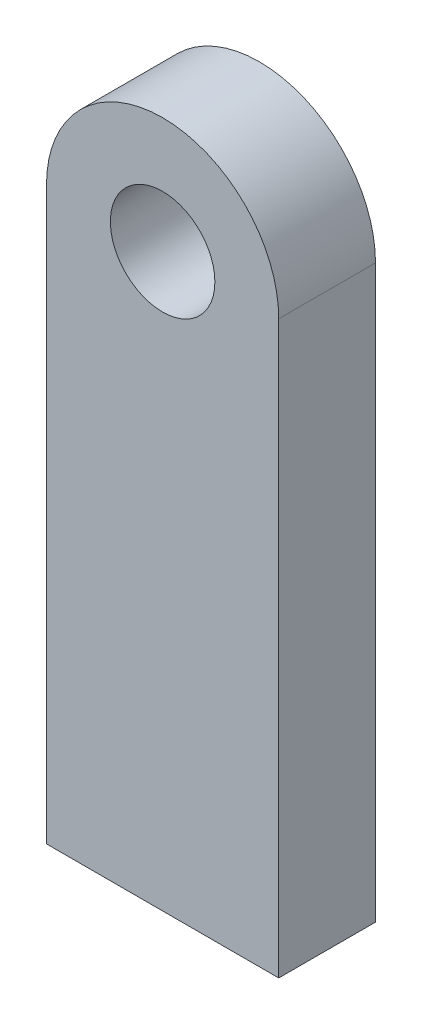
ISO-10303-21;
HEADER;
FILE_DESCRIPTION(('STEP AP214'),'2;1');
FILE_NAME('part.step','',(''),(''),'','','');
FILE_SCHEMA(('AUTOMOTIVE_DESIGN { 1 0 10303 214 1 1 1 1 }'));
ENDSEC;
DATA;
#1=APPLICATION_CONTEXT('core data for automotive mechanical design processes');
#2=APPLICATION_PROTOCOL_DEFINITION('international standard','automotive_design',2000,#1);
#3=PRODUCT_CONTEXT('',#1,'mechanical');
#4=PRODUCT('Part','Part','',(#3));
#5=PRODUCT_RELATED_PRODUCT_CATEGORY('part','',(#4));
#6=PRODUCT_DEFINITION_FORMATION('','',#4);
#7=PRODUCT_DEFINITION_CONTEXT('part definition',#1,'design');
#8=PRODUCT_DEFINITION('design','',#6,#7);
#9=PRODUCT_DEFINITION_SHAPE('','',#8);
#10=(LENGTH_UNIT() NAMED_UNIT(*) SI_UNIT(.MILLI.,.METRE.));
#11=(NAMED_UNIT(*) PLANE_ANGLE_UNIT() SI_UNIT($,.RADIAN.));
#12=(NAMED_UNIT(*) SI_UNIT($,.STERADIAN.) SOLID_ANGLE_UNIT());
#13=UNCERTAINTY_MEASURE_WITH_UNIT(LENGTH_MEASURE(1.E-05),#10,'distance_accuracy_value','');
#14=(GEOMETRIC_REPRESENTATION_CONTEXT(3) GLOBAL_UNCERTAINTY_ASSIGNED_CONTEXT((#13)) GLOBAL_UNIT_ASSIGNED_CONTEXT((#10,
#11,#12)) REPRESENTATION_CONTEXT('',''));
#15=CARTESIAN_POINT('',(0.,0.,0.));
#16=DIRECTION('',(0.,0.,1.));
#17=DIRECTION('',(1.,0.,0.));
#18=AXIS2_PLACEMENT_3D('',#15,#16,#17);
#19=CARTESIAN_POINT('',(7.62,37.465,6.35));
#20=DIRECTION('',(0.,0.,-1.));
#21=DIRECTION('',(-1.,0.,0.));
#22=AXIS2_PLACEMENT_3D('',#19,#20,#21);
#23=CYLINDRICAL_SURFACE('',#22,7.62);
#24=CARTESIAN_POINT('',(7.62,37.465,0.));
#25=DIRECTION('',(0.,0.,1.));
#26=DIRECTION('',(1.,0.,0.));
#27=AXIS2_PLACEMENT_3D('',#24,#25,#26);
#28=CIRCLE('',#27,7.62);
#29=CARTESIAN_POINT('',(0.,37.465,0.));
#30=VERTEX_POINT('',#29);
#31=CARTESIAN_POINT('',(15.24,37.465,0.));
#32=VERTEX_POINT('',#31);
#33=EDGE_CURVE('E125',#30,#32,#28,.F.);
#34=ORIENTED_EDGE('',*,*,#33,.F.);
#35=DIRECTION('',(0.,0.,-1.));
#36=VECTOR('',#35,1.);
#37=CARTESIAN_POINT('',(0.,37.465,6.35));
#38=LINE('',#37,#36);
#39=CARTESIAN_POINT('',(0.,37.465,6.35));
#40=VERTEX_POINT('',#39);
#41=EDGE_CURVE('E11',#40,#30,#38,.T.);
#42=ORIENTED_EDGE('',*,*,#41,.F.);
#43=CARTESIAN_POINT('',(7.62,37.465,6.35));
#44=DIRECTION('',(0.,0.,1.));
#45=DIRECTION('',(1.,0.,0.));
#46=AXIS2_PLACEMENT_3D('',#43,#44,#45);
#47=CIRCLE('',#46,7.62);
#48=CARTESIAN_POINT('',(15.24,37.465,6.35));
#49=VERTEX_POINT('',#48);
#50=EDGE_CURVE('E111',#40,#49,#47,.F.);
#51=ORIENTED_EDGE('',*,*,#50,.T.);
#52=DIRECTION('',(0.,0.,-1.));
#53=VECTOR('',#52,1.);
#54=CARTESIAN_POINT('',(15.24,37.465,6.35));
#55=LINE('',#54,#53);
#56=EDGE_CURVE('E88',#49,#32,#55,.T.);
#57=ORIENTED_EDGE('',*,*,#56,.T.);
#58=EDGE_LOOP('',(#34,#42,#51,#57));
#59=FACE_BOUND('',#58,.T.);
#60=ADVANCED_FACE('F47',(#59),#23,.T.);
#61=CARTESIAN_POINT('',(0.,0.,6.35));
#62=DIRECTION('',(-1.,0.,0.));
#63=DIRECTION('',(0.,0.,1.));
#64=AXIS2_PLACEMENT_3D('',#61,#62,#63);
#65=PLANE('',#64);
#66=DIRECTION('',(0.,1.,0.));
#67=VECTOR('',#66,1.);
#68=CARTESIAN_POINT('',(0.,0.,0.));
#69=LINE('',#68,#67);
#70=CARTESIAN_POINT('',(0.,0.,0.));
#71=VERTEX_POINT('',#70);
#72=EDGE_CURVE('E100',#71,#30,#69,.T.);
#73=ORIENTED_EDGE('',*,*,#72,.F.);
#74=DIRECTION('',(0.,0.,-1.));
#75=VECTOR('',#74,1.);
#76=CARTESIAN_POINT('',(0.,0.,6.35));
#77=LINE('',#76,#75);
#78=CARTESIAN_POINT('',(0.,0.,6.35));
#79=VERTEX_POINT('',#78);
#80=EDGE_CURVE('E57',#79,#71,#77,.T.);
#81=ORIENTED_EDGE('',*,*,#80,.F.);
#82=DIRECTION('',(0.,1.,0.));
#83=VECTOR('',#82,1.);
#84=CARTESIAN_POINT('',(0.,0.,6.35));
#85=LINE('',#84,#83);
#86=EDGE_CURVE('E98',#79,#40,#85,.T.);
#87=ORIENTED_EDGE('',*,*,#86,.T.);
#88=ORIENTED_EDGE('',*,*,#41,.T.);
#89=EDGE_LOOP('',(#73,#81,#87,#88));
#90=FACE_BOUND('',#89,.T.);
#91=ADVANCED_FACE('F96',(#90),#65,.T.);
#92=CARTESIAN_POINT('',(0.,0.,6.35));
#93=DIRECTION('',(0.,1.,0.));
#94=DIRECTION('',(0.,0.,1.));
#95=AXIS2_PLACEMENT_3D('',#92,#93,#94);
#96=PLANE('',#95);
#97=DIRECTION('',(1.,0.,0.));
#98=VECTOR('',#97,1.);
#99=CARTESIAN_POINT('',(0.,0.,0.));
#100=LINE('',#99,#98);
#101=CARTESIAN_POINT('',(15.24,0.,0.));
#102=VERTEX_POINT('',#101);
#103=EDGE_CURVE('E130',#71,#102,#100,.T.);
#104=ORIENTED_EDGE('',*,*,#103,.T.);
#105=DIRECTION('',(0.,0.,-1.));
#106=VECTOR('',#105,1.);
#107=CARTESIAN_POINT('',(15.24,0.,6.35));
#108=LINE('',#107,#106);
#109=CARTESIAN_POINT('',(15.24,0.,6.35));
#110=VERTEX_POINT('',#109);
#111=EDGE_CURVE('E104',#110,#102,#108,.T.);
#112=ORIENTED_EDGE('',*,*,#111,.F.);
#113=DIRECTION('',(1.,0.,0.));
#114=VECTOR('',#113,1.);
#115=CARTESIAN_POINT('',(0.,0.,6.35));
#116=LINE('',#115,#114);
#117=EDGE_CURVE('E106',#79,#110,#116,.T.);
#118=ORIENTED_EDGE('',*,*,#117,.F.);
#119=ORIENTED_EDGE('',*,*,#80,.T.);
#120=EDGE_LOOP('',(#104,#112,#118,#119));
#121=FACE_BOUND('',#120,.T.);
#122=ADVANCED_FACE('F107',(#121),#96,.F.);
#123=CARTESIAN_POINT('',(7.62,37.465,6.35));
#124=DIRECTION('',(0.,0.,-1.));
#125=DIRECTION('',(-1.,0.,0.));
#126=AXIS2_PLACEMENT_3D('',#123,#124,#125);
#127=CYLINDRICAL_SURFACE('',#126,3.429);
#128=CARTESIAN_POINT('',(7.62,37.465,6.35));
#129=DIRECTION('',(0.,0.,1.));
#130=DIRECTION('',(1.,0.,0.));
#131=AXIS2_PLACEMENT_3D('',#128,#129,#130);
#132=CIRCLE('',#131,3.429);
#133=CARTESIAN_POINT('',(11.049,37.465,6.35));
#134=VERTEX_POINT('',#133);
#135=EDGE_CURVE('E115',#134,#134,#132,.T.);
#136=ORIENTED_EDGE('',*,*,#135,.T.);
#137=EDGE_LOOP('',(#136));
#138=FACE_BOUND('',#137,.T.);
#139=CARTESIAN_POINT('',(7.62,37.465,0.));
#140=DIRECTION('',(0.,0.,1.));
#141=DIRECTION('',(1.,0.,0.));
#142=AXIS2_PLACEMENT_3D('',#139,#140,#141);
#143=CIRCLE('',#142,3.429);
#144=CARTESIAN_POINT('',(11.049,37.465,0.));
#145=VERTEX_POINT('',#144);
#146=EDGE_CURVE('E121',#145,#145,#143,.T.);
#147=ORIENTED_EDGE('',*,*,#146,.F.);
#148=EDGE_LOOP('',(#147));
#149=FACE_BOUND('',#148,.T.);
#150=ADVANCED_FACE('F49',(#138,#149),#127,.F.);
#151=CARTESIAN_POINT('',(15.24,0.,6.35));
#152=DIRECTION('',(-1.,0.,0.));
#153=DIRECTION('',(0.,0.,1.));
#154=AXIS2_PLACEMENT_3D('',#151,#152,#153);
#155=PLANE('',#154);
#156=DIRECTION('',(0.,1.,0.));
#157=VECTOR('',#156,1.);
#158=CARTESIAN_POINT('',(15.24,0.,0.));
#159=LINE('',#158,#157);
#160=EDGE_CURVE('E81',#102,#32,#159,.T.);
#161=ORIENTED_EDGE('',*,*,#160,.T.);
#162=ORIENTED_EDGE('',*,*,#56,.F.);
#163=DIRECTION('',(0.,1.,0.));
#164=VECTOR('',#163,1.);
#165=CARTESIAN_POINT('',(15.24,0.,6.35));
#166=LINE('',#165,#164);
#167=EDGE_CURVE('E65',#110,#49,#166,.T.);
#168=ORIENTED_EDGE('',*,*,#167,.F.);
#169=ORIENTED_EDGE('',*,*,#111,.T.);
#170=EDGE_LOOP('',(#161,#162,#168,#169));
#171=FACE_BOUND('',#170,.T.);
#172=ADVANCED_FACE('F139',(#171),#155,.F.);
#173=CARTESIAN_POINT('',(0.,0.,6.35));
#174=DIRECTION('',(0.,0.,1.));
#175=DIRECTION('',(1.,0.,0.));
#176=AXIS2_PLACEMENT_3D('',#173,#174,#175);
#177=PLANE('',#176);
#178=ORIENTED_EDGE('',*,*,#135,.F.);
#179=EDGE_LOOP('',(#178));
#180=FACE_BOUND('',#179,.T.);
#181=ORIENTED_EDGE('',*,*,#50,.F.);
#182=ORIENTED_EDGE('',*,*,#86,.F.);
#183=ORIENTED_EDGE('',*,*,#117,.T.);
#184=ORIENTED_EDGE('',*,*,#167,.T.);
#185=EDGE_LOOP('',(#181,#182,#183,#184));
#186=FACE_BOUND('',#185,.T.);
#187=ADVANCED_FACE('F110',(#180,#186),#177,.T.);
#188=CARTESIAN_POINT('',(0.,0.,0.));
#189=DIRECTION('',(0.,0.,1.));
#190=DIRECTION('',(1.,0.,0.));
#191=AXIS2_PLACEMENT_3D('',#188,#189,#190);
#192=PLANE('',#191);
#193=ORIENTED_EDGE('',*,*,#146,.T.);
#194=EDGE_LOOP('',(#193));
#195=FACE_BOUND('',#194,.T.);
#196=ORIENTED_EDGE('',*,*,#33,.T.);
#197=ORIENTED_EDGE('',*,*,#160,.F.);
#198=ORIENTED_EDGE('',*,*,#103,.F.);
#199=ORIENTED_EDGE('',*,*,#72,.T.);
#200=EDGE_LOOP('',(#196,#197,#198,#199));
#201=FACE_BOUND('',#200,.T.);
#202=ADVANCED_FACE('F140',(#195,#201),#192,.F.);
#203=CLOSED_SHELL('',(#60,#91,#122,#150,#172,#187,#202));
#204=MANIFOLD_SOLID_BREP('B2',#203);
#205=ADVANCED_BREP_SHAPE_REPRESENTATION('',(#18,#204),#14);
#206=SHAPE_DEFINITION_REPRESENTATION(#9,#205);
ENDSEC;
END-ISO-10303-21;
